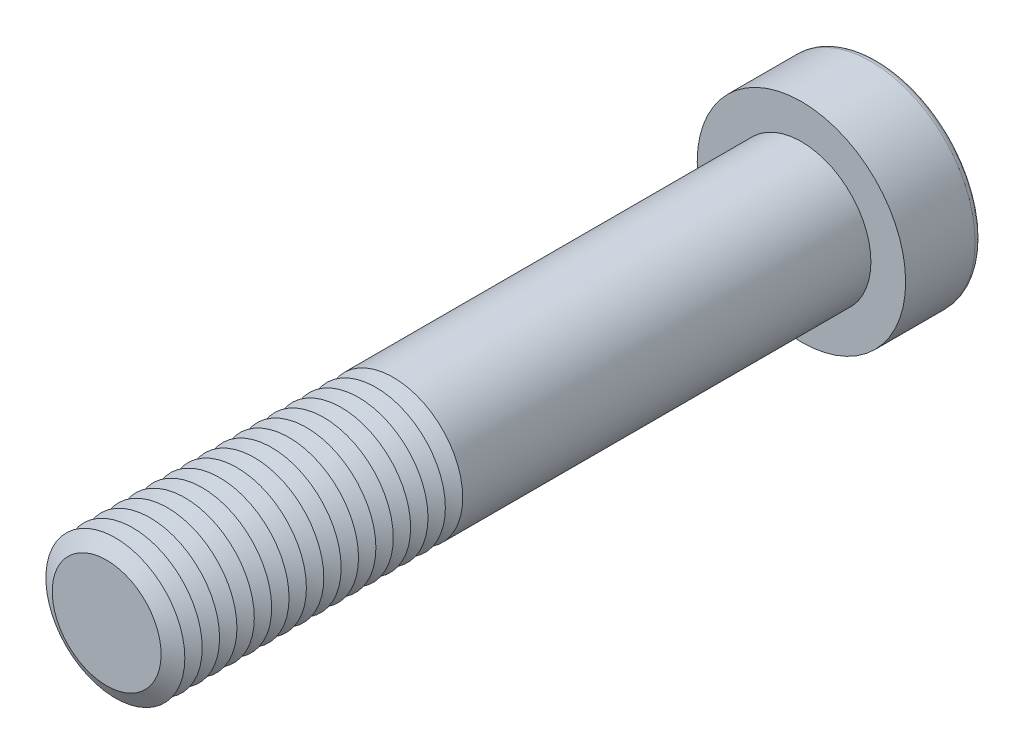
from build123d import *

# Parameters (mm, degrees)
SKETCH1_R           = 10
BOSS_EXTRUDE1_DEPTH = 100
SKETCH2_R           = 15
BOSS_EXTRUDE2_DEPTH = 11
CUT_EXTRUDE1_DEPTH  = 10.5
FILLET1_R           = 1
LPATTERN1_COUNT     = 17
LPATTERN1_PITCH     = 2.5


with BuildPart() as part:
    # Sketch1 → Boss-Extrude1 (new body)
    with BuildSketch(Plane.XY):
        Circle(SKETCH1_R)
    extrude(amount=BOSS_EXTRUDE1_DEPTH)

    # Sketch2 → Boss-Extrude2 (add)
    with BuildSketch(Plane(origin=(0, 0, 0), x_dir=(-1, 0, 0), z_dir=(0, 0, -1))):
        Circle(SKETCH2_R)
    extrude(amount=BOSS_EXTRUDE2_DEPTH)

    # Sketch3 → Cut-Extrude1 (cut)
    with BuildSketch(Plane(origin=(0, 0, -11), x_dir=(-1, 0, 0), z_dir=(0, 0, -1))):
        Polygon((-4.041451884, 7), (-8.082903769, 0), (-4.041451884, -7), (4.041451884, -7), (8.082903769, 0), (4.041451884, 7), align=None)
    extrude(amount=-CUT_EXTRUDE1_DEPTH, mode=Mode.SUBTRACT)

    # Fillet1
    fillet1_edges = [part.edges().sort_by_distance(p)[0] for p in [
        (15, 0, -11),
    ]]
    fillet(fillet1_edges, radius=FILLET1_R)

    # Cut-Extrude2 cone 1 section (on through the dimple's axis) → Cut-Extrude2 (revolve, cut)
    with BuildSketch(Plane(origin=(0, 0, -0.5), x_dir=(0, 1, 0), z_dir=(1, 0, 0))):
        Polygon((0, 0), (7, 0), (0, 4.041451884), align=None)
    revolve(axis=Axis((0, 0, -0.5), (0, 0, 1)), mode=Mode.SUBTRACT)

    # Cut-Extrude3 cone 1 section (on through the dimple's axis) → Cut-Extrude3 (revolve, cut)
    with BuildSketch(Plane(origin=(0, 0, -11), x_dir=(0, 1, 0), z_dir=(1, 0, 0))):
        Polygon((0, 0), (8.082903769, 0), (0, 2.165807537), align=None)
    revolve(axis=Axis((0, 0, -11), (0, 0, 1)), mode=Mode.SUBTRACT)

    # Sketch7 → Cut-Revolve1 (revolve, cut)
    with BuildSketch(Plane(origin=(0, 0, 0), x_dir=(0, 0, -1), z_dir=(1, 0, 0)), mode=Mode.PRIVATE) as cut_revolve1_sk:
        Polygon((-100, 7.834936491), (-98.75, 10), (-101.25, 10), align=None)
    cut_revolve1 = revolve(cut_revolve1_sk.sketch.rotate(Axis((0, 0, 100), (0, 0, -1)), 90), axis=Axis((0, 0, 100), (0, 0, -1)), mode=Mode.SUBTRACT)

    # LPattern1: Cut-Revolve1 ×17
    with Locations(*[(0, 0, -i * LPATTERN1_PITCH) for i in range(1, LPATTERN1_COUNT)]):
        add(cut_revolve1, mode=Mode.SUBTRACT)


solid = part.part
